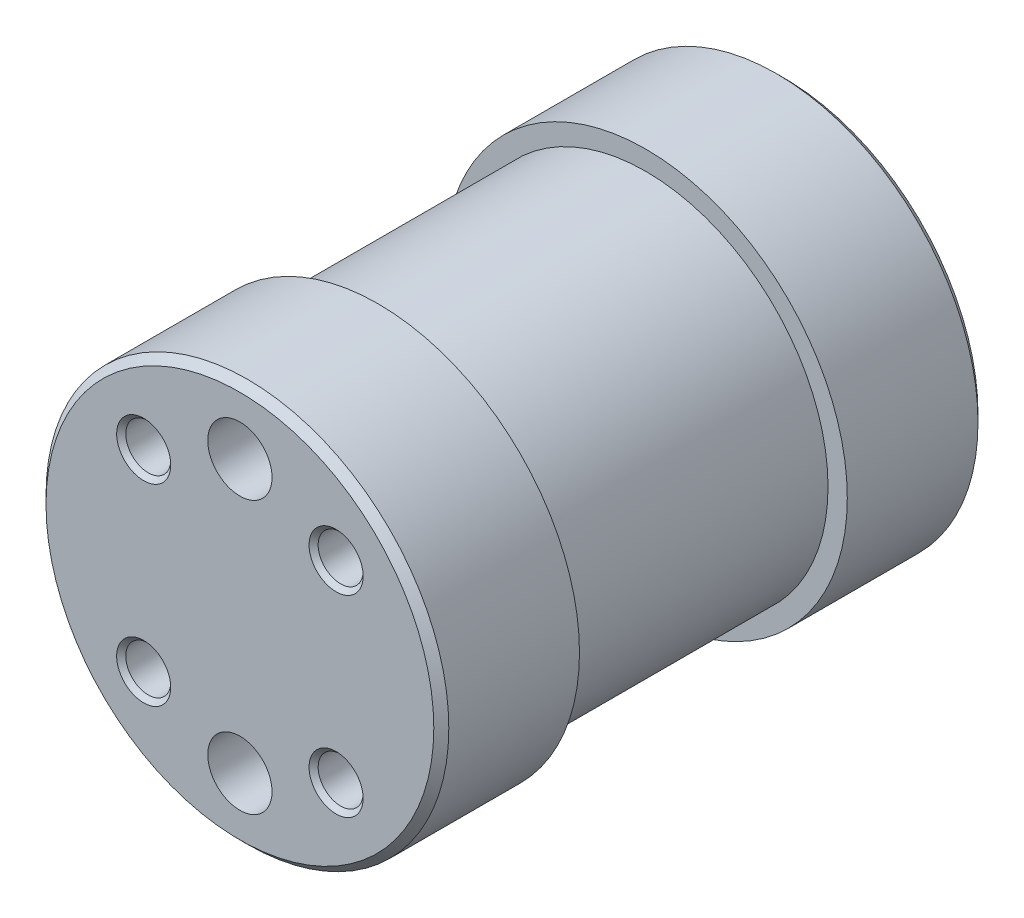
from build123d import *

# Parameters (mm, degrees)
CHAMFER1_SIZE           = 0.7
CIRPATTERN1_COUNT       = 4
SKETCH5_R               = 3
CUT_EXTRUDE1_DEPTH      = 10
MIRROR2_COPY_1_SKETCH_R = 3
MIRROR2_COPY_1_DEPTH    = 10


with BuildPart() as part:
    # Sketch2 → Revolve1 (revolve)
    with BuildSketch(Plane(origin=(0, 0, 0), x_dir=(1, 0, 0), z_dir=(0, 1, 0)), mode=Mode.PRIVATE) as revolve1_sk:
        Polygon((0, 25.4), (0, -25.4), (18.8, -25.4), (18.8, -12.5), (17, -12.5), (17, 12.5), (18.8, 12.5), (18.8, 25.4), align=None)
    revolve(revolve1_sk.sketch.rotate(Axis((0, 0, -25.4), (0, 0, 1)), 180), axis=Axis((0, 0, -25.4), (0, 0, 1)))

    # Chamfer1
    chamfer1_edges = [part.edges().sort_by_distance(p)[0] for p in [
        (18.8, 0, -25.4),
        (18.8, 0, 25.4),
    ]]
    chamfer(chamfer1_edges, length=CHAMFER1_SIZE)

    # Sketch3 → M5x0.8 Tapped Hole1 (revolve, cut)
    with BuildSketch(Plane(origin=(-8.980256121, -8.980256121, 25.4), x_dir=(0, -1, 0), z_dir=(1, 0, 0))):
        Polygon((0, 0), (0, 15.2618073), (2.1, 14), (2.1, 0.425), (2.525, 0), align=None)
    m5x0_8_tapped_hole1 = revolve(axis=Axis((-8.980256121, -8.980256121, 31.75), (0, 0, -1)), mode=Mode.SUBTRACT)

    # CirPattern1: M5x0.8 Tapped Hole1 ×4 about axis
    cirpattern1_axis = Axis((0, 0, 0), (0, 0, 1))
    for i in range(1, CIRPATTERN1_COUNT):
        add(m5x0_8_tapped_hole1.rotate(cirpattern1_axis, i * 360 / CIRPATTERN1_COUNT), mode=Mode.SUBTRACT)

    # Mirror3: M5x0.8 Tapped Hole1 across plane
    add(m5x0_8_tapped_hole1.mirror(Plane.XY), mode=Mode.SUBTRACT)

    # Mirror3 copy 1 sketch → Mirror3 copy 1 (revolve, cut)
    with BuildSketch(Plane(origin=(8.980256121, -8.980256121, -25.4), x_dir=(1, 0, 0), z_dir=(0, 1, 0))):
        Polygon((0, 0), (0, -15.2618073), (2.1, -14), (2.1, -0.425), (2.525, 0), align=None)
    revolve(axis=Axis((8.980256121, -8.980256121, -31.75), (0, 0, -1)), mode=Mode.SUBTRACT)

    # Mirror3 copy 2 sketch → Mirror3 copy 2 (revolve, cut)
    with BuildSketch(Plane(origin=(8.980256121, 8.980256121, -25.4), x_dir=(0, 1, 0), z_dir=(-1, 0, 0))):
        Polygon((0, 0), (0, -15.2618073), (2.1, -14), (2.1, -0.425), (2.525, 0), align=None)
    revolve(axis=Axis((8.980256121, 8.980256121, -31.75), (0, 0, -1)), mode=Mode.SUBTRACT)

    # Mirror3 copy 3 sketch → Mirror3 copy 3 (revolve, cut)
    with BuildSketch(Plane(origin=(-8.980256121, 8.980256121, -25.4), x_dir=(-1, 0, 0), z_dir=(0, -1, 0))):
        Polygon((0, 0), (0, -15.2618073), (2.1, -14), (2.1, -0.425), (2.525, 0), align=None)
    revolve(axis=Axis((-8.980256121, 8.980256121, -31.75), (0, 0, -1)), mode=Mode.SUBTRACT)

    # Sketch5 → Cut-Extrude1 (cut)
    with BuildSketch(Plane.XY.offset(25.4)):
        with Locations((0, 12.7)):
            Circle(SKETCH5_R)
    cut_extrude1 = extrude(amount=-CUT_EXTRUDE1_DEPTH, mode=Mode.SUBTRACT)

    # Mirror1: Cut-Extrude1 across plane
    add(cut_extrude1.mirror(Plane.ZX), mode=Mode.SUBTRACT)

    # Mirror2: Cut-Extrude1 across plane
    add(cut_extrude1.mirror(Plane.XY), mode=Mode.SUBTRACT)

    # Mirror2 copy 1 sketch → Mirror2 copy 1 (cut)
    with BuildSketch(Plane(origin=(0, 0, -25.4), x_dir=(1, 0, 0), z_dir=(0, 0, -1))):
        with Locations((0, 12.7)):
            Circle(MIRROR2_COPY_1_SKETCH_R)
    extrude(amount=-MIRROR2_COPY_1_DEPTH, mode=Mode.SUBTRACT)


solid = part.part
